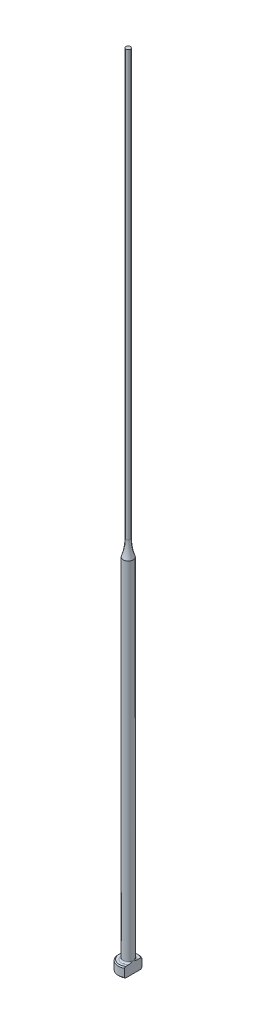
from build123d import *
from build123d.topology import SkipClean

# Parameters (mm, degrees)
CHAMFER1_SIZE = 0.2
FILLET1_R     = 0.3
KEY_DEPTH     = 161.024998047


with BuildPart() as part:
    # Sketch1 → Revolve1 (revolve)
    with BuildSketch(Plane.XY, mode=Mode.PRIVATE) as revolve1_sk:
        with BuildLine():
            Line((0, 0), (-2, 0))
            Line((-2, 0), (-2, 2))
            Line((-2, 2), (-1, 2))
            Line((-1, 2), (-1, 71.729296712))
            ThreePointArc((-1, 71.729296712), (-0.588458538, 73.341687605), (-0.45, 75))
            Line((-0.45, 75), (-0.45, 160))
            Line((-0.45, 160), (0, 160))
            Line((0, 160), (0, 0))
        make_face()
    revolve(revolve1_sk.sketch.rotate(Axis((0, 259.958771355, 0), (0, -1, 0)), 270), axis=Axis((0, 259.958771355, 0), (0, -1, 0)))

    # Chamfer1
    chamfer1_edges = [part.edges().sort_by_distance(p)[0] for p in [
        (0, 0, -2),
        (0, 2, -2),
    ]]
    chamfer(chamfer1_edges, length=CHAMFER1_SIZE)

    # Fillet1
    fillet1_edges = [part.edges().sort_by_distance(p)[0] for p in [
        (0, 2, -1),
    ]]
    fillet(fillet1_edges, radius=FILLET1_R)

    # Sketch2 → KEY (cut, through all)
    with SkipClean():  # the faces are left unmerged after this step: merging them gives an invalid solid
        with BuildSketch(Plane(origin=(0, 0, 0), x_dir=(1, 0, 0), z_dir=(0, 1, 0))):
            with BuildLine():
                Line((1, 1.732050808), (1, -1.732050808))
                ThreePointArc((1, -1.732050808), (2, 0), (1, 1.732050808))
            make_face()
        extrude(amount=KEY_DEPTH, mode=Mode.SUBTRACT)


solid = part.part
